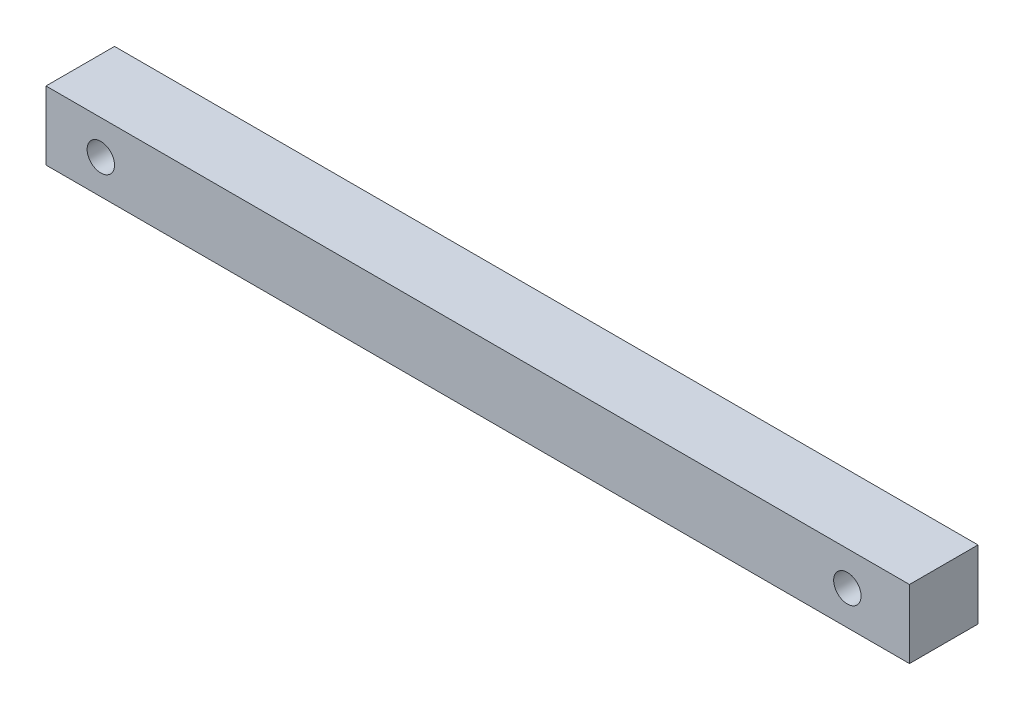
from build123d import *

# Parameters (mm, degrees)
SKETCH1_W           = 63
SKETCH1_H           = 5
BOSS_EXTRUDE1_DEPTH = 5
SKETCH2_R           = 1
CUT_EXTRUDE1_DEPTH  = 5


with BuildPart() as part:
    # Sketch1 → Boss-Extrude1 (new body)
    with BuildSketch(Plane.XY):
        with Locations((-1.5, 0)):
            Rectangle(SKETCH1_W, SKETCH1_H)
    extrude(amount=BOSS_EXTRUDE1_DEPTH)

    # Sketch2 → Cut-Extrude1 (cut)
    with BuildSketch(Plane.XY.offset(5)):
        with Locations((-29, 0)):
            Circle(SKETCH2_R)
        with Locations((25.4676814, 0)):
            Circle(SKETCH2_R)
    extrude(amount=-CUT_EXTRUDE1_DEPTH, mode=Mode.SUBTRACT)


solid = part.part
